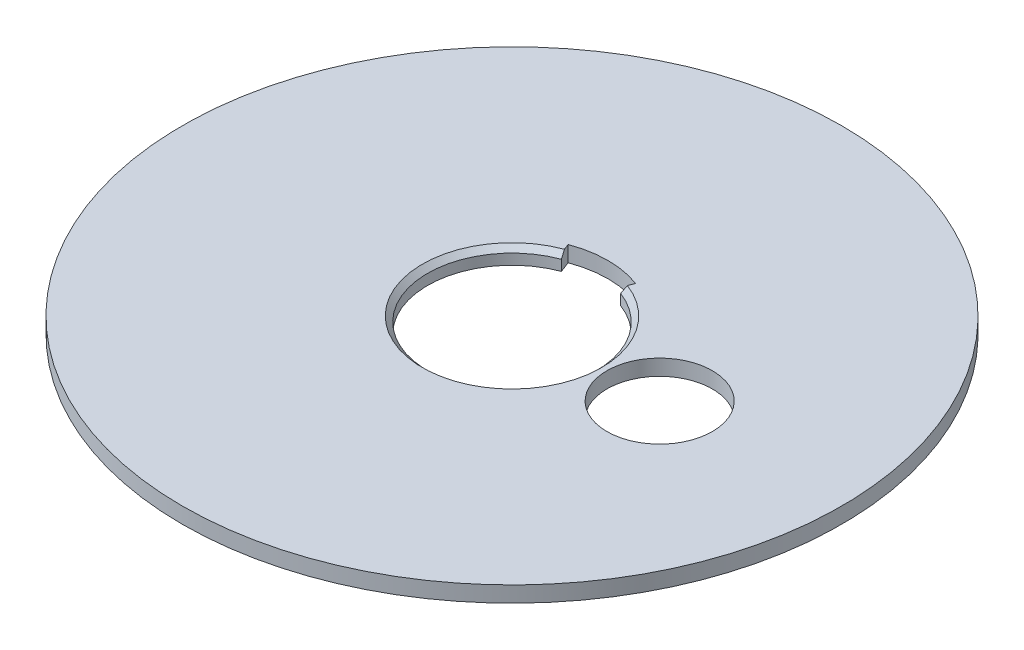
from build123d import *

# Parameters (mm, degrees)
SKETCH1_R           = 31.25
SKETCH1_R_2         = 5
BOSS_EXTRUDE1_DEPTH = 1.5
CHAMFER1_SIZE       = 0.5


with BuildPart() as part:
    # Sketch1 → Boss-Extrude1 (new body)
    with BuildSketch(Plane(origin=(0, 0, 0), x_dir=(1, 0, 0), z_dir=(0, 1, 0))):
        with Locations(Location((0, 0, 0), (0, 0, 270))):
            Circle(SKETCH1_R)
        with Locations(Location((14, 0, 0), (0, 0, 270))):
            Circle(SKETCH1_R_2, mode=Mode.SUBTRACT)
        with BuildLine():
            Line((2.808987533, 7.490633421), (3, 8))
            Line((3, 8), (3.195223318, 8.520595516))
            ThreePointArc((3.195223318, 8.520595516), (0, 9.1), (-3.195223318, 8.520595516))
            Line((-3.195223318, 8.520595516), (-3, 8))
            Line((-3, 8), (-2.808987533, 7.490633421))
            ThreePointArc((-2.808987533, 7.490633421), (0, -8), (2.808987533, 7.490633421))
        make_face(mode=Mode.SUBTRACT)
    extrude(amount=-BOSS_EXTRUDE1_DEPTH)

    # Chamfer1
    chamfer1_edges = [part.edges().sort_by_distance(p)[0] for p in [
        (0, 0, 8),
    ]]
    chamfer(chamfer1_edges, length=CHAMFER1_SIZE)


solid = part.part
